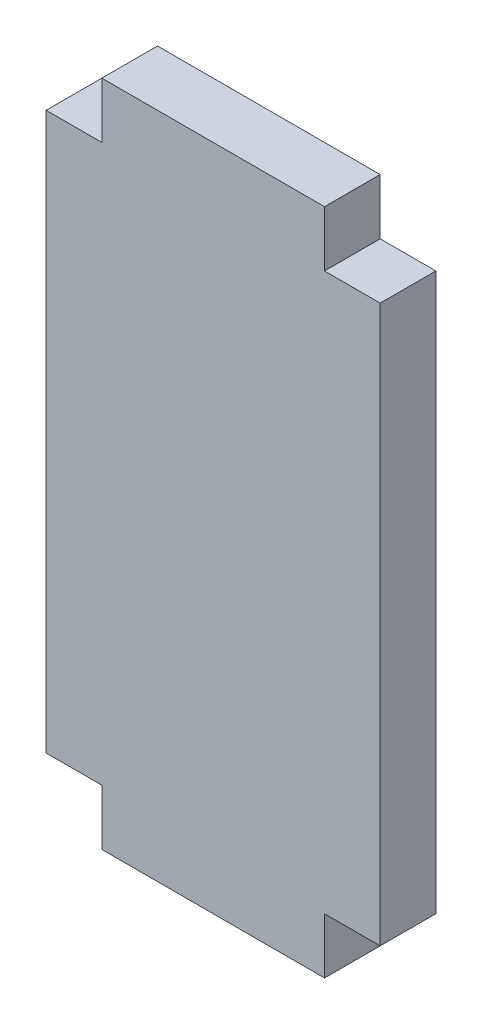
ISO-10303-21;
HEADER;
FILE_DESCRIPTION(('STEP AP214'),'2;1');
FILE_NAME('part.step','',(''),(''),'','','');
FILE_SCHEMA(('AUTOMOTIVE_DESIGN { 1 0 10303 214 1 1 1 1 }'));
ENDSEC;
DATA;
#1=APPLICATION_CONTEXT('core data for automotive mechanical design processes');
#2=APPLICATION_PROTOCOL_DEFINITION('international standard','automotive_design',2000,#1);
#3=PRODUCT_CONTEXT('',#1,'mechanical');
#4=PRODUCT('Part','Part','',(#3));
#5=PRODUCT_RELATED_PRODUCT_CATEGORY('part','',(#4));
#6=PRODUCT_DEFINITION_FORMATION('','',#4);
#7=PRODUCT_DEFINITION_CONTEXT('part definition',#1,'design');
#8=PRODUCT_DEFINITION('design','',#6,#7);
#9=PRODUCT_DEFINITION_SHAPE('','',#8);
#10=(LENGTH_UNIT() NAMED_UNIT(*) SI_UNIT(.MILLI.,.METRE.));
#11=(NAMED_UNIT(*) PLANE_ANGLE_UNIT() SI_UNIT($,.RADIAN.));
#12=(NAMED_UNIT(*) SI_UNIT($,.STERADIAN.) SOLID_ANGLE_UNIT());
#13=UNCERTAINTY_MEASURE_WITH_UNIT(LENGTH_MEASURE(1.E-05),#10,'distance_accuracy_value','');
#14=(GEOMETRIC_REPRESENTATION_CONTEXT(3) GLOBAL_UNCERTAINTY_ASSIGNED_CONTEXT((#13)) GLOBAL_UNIT_ASSIGNED_CONTEXT((#10,
#11,#12)) REPRESENTATION_CONTEXT('',''));
#15=CARTESIAN_POINT('',(0.,0.,0.));
#16=DIRECTION('',(0.,0.,1.));
#17=DIRECTION('',(1.,0.,0.));
#18=AXIS2_PLACEMENT_3D('',#15,#16,#17);
#19=CARTESIAN_POINT('',(9.525,19.05,1.5875));
#20=DIRECTION('',(-1.,0.,0.));
#21=DIRECTION('',(0.,0.,1.));
#22=AXIS2_PLACEMENT_3D('',#19,#20,#21);
#23=PLANE('',#22);
#24=DIRECTION('',(0.,1.,0.));
#25=VECTOR('',#24,1.);
#26=CARTESIAN_POINT('',(9.525,19.05,1.5875));
#27=LINE('',#26,#25);
#28=CARTESIAN_POINT('',(9.525,-15.875,1.5875));
#29=VERTEX_POINT('',#28);
#30=CARTESIAN_POINT('',(9.525,15.875,1.5875));
#31=VERTEX_POINT('',#30);
#32=EDGE_CURVE('E140',#29,#31,#27,.T.);
#33=ORIENTED_EDGE('',*,*,#32,.F.);
#34=DIRECTION('',(0.,0.,1.));
#35=VECTOR('',#34,1.);
#36=CARTESIAN_POINT('',(9.525,-15.875,-1.5875));
#37=LINE('',#36,#35);
#38=CARTESIAN_POINT('',(9.525,-15.875,-1.5875));
#39=VERTEX_POINT('',#38);
#40=EDGE_CURVE('E196',#39,#29,#37,.T.);
#41=ORIENTED_EDGE('',*,*,#40,.F.);
#42=DIRECTION('',(0.,1.,0.));
#43=VECTOR('',#42,1.);
#44=CARTESIAN_POINT('',(9.525,19.05,-1.5875));
#45=LINE('',#44,#43);
#46=CARTESIAN_POINT('',(9.525,15.875,-1.5875));
#47=VERTEX_POINT('',#46);
#48=EDGE_CURVE('E150',#39,#47,#45,.T.);
#49=ORIENTED_EDGE('',*,*,#48,.T.);
#50=DIRECTION('',(0.,0.,1.));
#51=VECTOR('',#50,1.);
#52=CARTESIAN_POINT('',(9.525,15.875,-1.5875));
#53=LINE('',#52,#51);
#54=EDGE_CURVE('E172',#47,#31,#53,.T.);
#55=ORIENTED_EDGE('',*,*,#54,.T.);
#56=EDGE_LOOP('',(#33,#41,#49,#55));
#57=FACE_BOUND('',#56,.T.);
#58=ADVANCED_FACE('F33',(#57),#23,.F.);
#59=CARTESIAN_POINT('',(-9.525,19.05,1.5875));
#60=DIRECTION('',(0.,-1.,0.));
#61=DIRECTION('',(0.,0.,-1.));
#62=AXIS2_PLACEMENT_3D('',#59,#60,#61);
#63=PLANE('',#62);
#64=DIRECTION('',(-1.,0.,0.));
#65=VECTOR('',#64,1.);
#66=CARTESIAN_POINT('',(-9.525,19.05,1.5875));
#67=LINE('',#66,#65);
#68=CARTESIAN_POINT('',(6.35,19.05,1.5875));
#69=VERTEX_POINT('',#68);
#70=CARTESIAN_POINT('',(-6.35,19.05,1.5875));
#71=VERTEX_POINT('',#70);
#72=EDGE_CURVE('E142',#69,#71,#67,.T.);
#73=ORIENTED_EDGE('',*,*,#72,.F.);
#74=DIRECTION('',(0.,0.,1.));
#75=VECTOR('',#74,1.);
#76=CARTESIAN_POINT('',(6.35,19.05,-1.5875));
#77=LINE('',#76,#75);
#78=CARTESIAN_POINT('',(6.35,19.05,-1.5875));
#79=VERTEX_POINT('',#78);
#80=EDGE_CURVE('E177',#79,#69,#77,.T.);
#81=ORIENTED_EDGE('',*,*,#80,.F.);
#82=DIRECTION('',(-1.,0.,0.));
#83=VECTOR('',#82,1.);
#84=CARTESIAN_POINT('',(-9.525,19.05,-1.5875));
#85=LINE('',#84,#83);
#86=CARTESIAN_POINT('',(-6.35,19.05,-1.5875));
#87=VERTEX_POINT('',#86);
#88=EDGE_CURVE('E145',#79,#87,#85,.T.);
#89=ORIENTED_EDGE('',*,*,#88,.T.);
#90=DIRECTION('',(0.,0.,1.));
#91=VECTOR('',#90,1.);
#92=CARTESIAN_POINT('',(-6.35,19.05,-1.5875));
#93=LINE('',#92,#91);
#94=EDGE_CURVE('E153',#87,#71,#93,.T.);
#95=ORIENTED_EDGE('',*,*,#94,.T.);
#96=EDGE_LOOP('',(#73,#81,#89,#95));
#97=FACE_BOUND('',#96,.T.);
#98=ADVANCED_FACE('F233',(#97),#63,.F.);
#99=CARTESIAN_POINT('',(-9.525,19.05,1.5875));
#100=DIRECTION('',(1.,0.,0.));
#101=DIRECTION('',(0.,1.,0.));
#102=AXIS2_PLACEMENT_3D('',#99,#100,#101);
#103=PLANE('',#102);
#104=DIRECTION('',(0.,-1.,0.));
#105=VECTOR('',#104,1.);
#106=CARTESIAN_POINT('',(-9.525,19.05,-1.5875));
#107=LINE('',#106,#105);
#108=CARTESIAN_POINT('',(-9.525,15.875,-1.5875));
#109=VERTEX_POINT('',#108);
#110=CARTESIAN_POINT('',(-9.525,-15.875,-1.5875));
#111=VERTEX_POINT('',#110);
#112=EDGE_CURVE('E141',#109,#111,#107,.T.);
#113=ORIENTED_EDGE('',*,*,#112,.T.);
#114=DIRECTION('',(0.,0.,1.));
#115=VECTOR('',#114,1.);
#116=CARTESIAN_POINT('',(-9.525,-15.875,-1.5875));
#117=LINE('',#116,#115);
#118=CARTESIAN_POINT('',(-9.525,-15.875,1.5875));
#119=VERTEX_POINT('',#118);
#120=EDGE_CURVE('E208',#111,#119,#117,.T.);
#121=ORIENTED_EDGE('',*,*,#120,.T.);
#122=DIRECTION('',(0.,-1.,0.));
#123=VECTOR('',#122,1.);
#124=CARTESIAN_POINT('',(-9.525,19.05,1.5875));
#125=LINE('',#124,#123);
#126=CARTESIAN_POINT('',(-9.525,15.875,1.5875));
#127=VERTEX_POINT('',#126);
#128=EDGE_CURVE('E41',#127,#119,#125,.T.);
#129=ORIENTED_EDGE('',*,*,#128,.F.);
#130=DIRECTION('',(0.,0.,1.));
#131=VECTOR('',#130,1.);
#132=CARTESIAN_POINT('',(-9.525,15.875,-1.5875));
#133=LINE('',#132,#131);
#134=EDGE_CURVE('E158',#109,#127,#133,.T.);
#135=ORIENTED_EDGE('',*,*,#134,.F.);
#136=EDGE_LOOP('',(#113,#121,#129,#135));
#137=FACE_BOUND('',#136,.T.);
#138=ADVANCED_FACE('F222',(#137),#103,.F.);
#139=CARTESIAN_POINT('',(-9.525,-19.05,1.5875));
#140=DIRECTION('',(0.,1.,0.));
#141=DIRECTION('',(0.,0.,1.));
#142=AXIS2_PLACEMENT_3D('',#139,#140,#141);
#143=PLANE('',#142);
#144=DIRECTION('',(1.,0.,0.));
#145=VECTOR('',#144,1.);
#146=CARTESIAN_POINT('',(-9.525,-19.05,1.5875));
#147=LINE('',#146,#145);
#148=CARTESIAN_POINT('',(-6.35,-19.05,1.5875));
#149=VERTEX_POINT('',#148);
#150=CARTESIAN_POINT('',(6.35,-19.05,1.5875));
#151=VERTEX_POINT('',#150);
#152=EDGE_CURVE('E11',#149,#151,#147,.T.);
#153=ORIENTED_EDGE('',*,*,#152,.F.);
#154=DIRECTION('',(0.,0.,1.));
#155=VECTOR('',#154,1.);
#156=CARTESIAN_POINT('',(-6.35,-19.05,-1.5875));
#157=LINE('',#156,#155);
#158=CARTESIAN_POINT('',(-6.35,-19.05,-1.5875));
#159=VERTEX_POINT('',#158);
#160=EDGE_CURVE('E126',#159,#149,#157,.T.);
#161=ORIENTED_EDGE('',*,*,#160,.F.);
#162=DIRECTION('',(1.,0.,0.));
#163=VECTOR('',#162,1.);
#164=CARTESIAN_POINT('',(-9.525,-19.05,-1.5875));
#165=LINE('',#164,#163);
#166=CARTESIAN_POINT('',(6.35,-19.05,-1.5875));
#167=VERTEX_POINT('',#166);
#168=EDGE_CURVE('E36',#159,#167,#165,.T.);
#169=ORIENTED_EDGE('',*,*,#168,.T.);
#170=DIRECTION('',(0.,0.,1.));
#171=VECTOR('',#170,1.);
#172=CARTESIAN_POINT('',(6.35,-19.05,-1.5875));
#173=LINE('',#172,#171);
#174=EDGE_CURVE('E191',#167,#151,#173,.T.);
#175=ORIENTED_EDGE('',*,*,#174,.T.);
#176=EDGE_LOOP('',(#153,#161,#169,#175));
#177=FACE_BOUND('',#176,.T.);
#178=ADVANCED_FACE('F135',(#177),#143,.F.);
#179=CARTESIAN_POINT('',(9.525,-19.05,1.5875));
#180=DIRECTION('',(0.,0.,1.));
#181=DIRECTION('',(1.,0.,0.));
#182=AXIS2_PLACEMENT_3D('',#179,#180,#181);
#183=PLANE('',#182);
#184=DIRECTION('',(-1.,0.,0.));
#185=VECTOR('',#184,1.);
#186=CARTESIAN_POINT('',(-9.525,-15.875,1.5875));
#187=LINE('',#186,#185);
#188=CARTESIAN_POINT('',(-6.35,-15.875,1.5875));
#189=VERTEX_POINT('',#188);
#190=EDGE_CURVE('E131',#189,#119,#187,.T.);
#191=ORIENTED_EDGE('',*,*,#190,.F.);
#192=DIRECTION('',(0.,1.,0.));
#193=VECTOR('',#192,1.);
#194=CARTESIAN_POINT('',(-6.35,-19.05,1.5875));
#195=LINE('',#194,#193);
#196=EDGE_CURVE('E214',#149,#189,#195,.T.);
#197=ORIENTED_EDGE('',*,*,#196,.F.);
#198=ORIENTED_EDGE('',*,*,#152,.T.);
#199=DIRECTION('',(0.,-1.,0.));
#200=VECTOR('',#199,1.);
#201=CARTESIAN_POINT('',(6.35,-19.05,1.5875));
#202=LINE('',#201,#200);
#203=CARTESIAN_POINT('',(6.35,-15.875,1.5875));
#204=VERTEX_POINT('',#203);
#205=EDGE_CURVE('E201',#204,#151,#202,.T.);
#206=ORIENTED_EDGE('',*,*,#205,.F.);
#207=DIRECTION('',(-1.,0.,0.));
#208=VECTOR('',#207,1.);
#209=CARTESIAN_POINT('',(9.525,-15.875,1.5875));
#210=LINE('',#209,#208);
#211=EDGE_CURVE('E205',#29,#204,#210,.T.);
#212=ORIENTED_EDGE('',*,*,#211,.F.);
#213=ORIENTED_EDGE('',*,*,#32,.T.);
#214=DIRECTION('',(1.,0.,0.));
#215=VECTOR('',#214,1.);
#216=CARTESIAN_POINT('',(9.525,15.875,1.5875));
#217=LINE('',#216,#215);
#218=CARTESIAN_POINT('',(6.35,15.875,1.5875));
#219=VERTEX_POINT('',#218);
#220=EDGE_CURVE('E184',#219,#31,#217,.T.);
#221=ORIENTED_EDGE('',*,*,#220,.F.);
#222=DIRECTION('',(0.,-1.,0.));
#223=VECTOR('',#222,1.);
#224=CARTESIAN_POINT('',(6.35,19.05,1.5875));
#225=LINE('',#224,#223);
#226=EDGE_CURVE('E188',#69,#219,#225,.T.);
#227=ORIENTED_EDGE('',*,*,#226,.F.);
#228=ORIENTED_EDGE('',*,*,#72,.T.);
#229=DIRECTION('',(0.,1.,0.));
#230=VECTOR('',#229,1.);
#231=CARTESIAN_POINT('',(-6.35,19.05,1.5875));
#232=LINE('',#231,#230);
#233=CARTESIAN_POINT('',(-6.35,15.875,1.5875));
#234=VERTEX_POINT('',#233);
#235=EDGE_CURVE('E165',#234,#71,#232,.T.);
#236=ORIENTED_EDGE('',*,*,#235,.F.);
#237=DIRECTION('',(1.,0.,0.));
#238=VECTOR('',#237,1.);
#239=CARTESIAN_POINT('',(-9.525,15.875,1.5875));
#240=LINE('',#239,#238);
#241=EDGE_CURVE('E169',#127,#234,#240,.T.);
#242=ORIENTED_EDGE('',*,*,#241,.F.);
#243=ORIENTED_EDGE('',*,*,#128,.T.);
#244=EDGE_LOOP('',(#191,#197,#198,#206,#212,#213,#221,#227,#228,#236,#242,#243));
#245=FACE_BOUND('',#244,.T.);
#246=ADVANCED_FACE('F225',(#245),#183,.T.);
#247=CARTESIAN_POINT('',(9.525,-19.05,-1.5875));
#248=DIRECTION('',(0.,0.,1.));
#249=DIRECTION('',(1.,0.,0.));
#250=AXIS2_PLACEMENT_3D('',#247,#248,#249);
#251=PLANE('',#250);
#252=DIRECTION('',(0.,1.,0.));
#253=VECTOR('',#252,1.);
#254=CARTESIAN_POINT('',(-6.35,-19.05,-1.5875));
#255=LINE('',#254,#253);
#256=CARTESIAN_POINT('',(-6.35,-15.875,-1.5875));
#257=VERTEX_POINT('',#256);
#258=EDGE_CURVE('E122',#159,#257,#255,.T.);
#259=ORIENTED_EDGE('',*,*,#258,.T.);
#260=DIRECTION('',(-1.,0.,0.));
#261=VECTOR('',#260,1.);
#262=CARTESIAN_POINT('',(-9.525,-15.875,-1.5875));
#263=LINE('',#262,#261);
#264=EDGE_CURVE('E49',#257,#111,#263,.T.);
#265=ORIENTED_EDGE('',*,*,#264,.T.);
#266=ORIENTED_EDGE('',*,*,#112,.F.);
#267=DIRECTION('',(1.,0.,0.));
#268=VECTOR('',#267,1.);
#269=CARTESIAN_POINT('',(-9.525,15.875,-1.5875));
#270=LINE('',#269,#268);
#271=CARTESIAN_POINT('',(-6.35,15.875,-1.5875));
#272=VERTEX_POINT('',#271);
#273=EDGE_CURVE('E168',#109,#272,#270,.T.);
#274=ORIENTED_EDGE('',*,*,#273,.T.);
#275=DIRECTION('',(0.,1.,0.));
#276=VECTOR('',#275,1.);
#277=CARTESIAN_POINT('',(-6.35,19.05,-1.5875));
#278=LINE('',#277,#276);
#279=EDGE_CURVE('E161',#272,#87,#278,.T.);
#280=ORIENTED_EDGE('',*,*,#279,.T.);
#281=ORIENTED_EDGE('',*,*,#88,.F.);
#282=DIRECTION('',(0.,-1.,0.));
#283=VECTOR('',#282,1.);
#284=CARTESIAN_POINT('',(6.35,19.05,-1.5875));
#285=LINE('',#284,#283);
#286=CARTESIAN_POINT('',(6.35,15.875,-1.5875));
#287=VERTEX_POINT('',#286);
#288=EDGE_CURVE('E187',#79,#287,#285,.T.);
#289=ORIENTED_EDGE('',*,*,#288,.T.);
#290=DIRECTION('',(1.,0.,0.));
#291=VECTOR('',#290,1.);
#292=CARTESIAN_POINT('',(9.525,15.875,-1.5875));
#293=LINE('',#292,#291);
#294=EDGE_CURVE('E180',#287,#47,#293,.T.);
#295=ORIENTED_EDGE('',*,*,#294,.T.);
#296=ORIENTED_EDGE('',*,*,#48,.F.);
#297=DIRECTION('',(-1.,0.,0.));
#298=VECTOR('',#297,1.);
#299=CARTESIAN_POINT('',(9.525,-15.875,-1.5875));
#300=LINE('',#299,#298);
#301=CARTESIAN_POINT('',(6.35,-15.875,-1.5875));
#302=VERTEX_POINT('',#301);
#303=EDGE_CURVE('E204',#39,#302,#300,.T.);
#304=ORIENTED_EDGE('',*,*,#303,.T.);
#305=DIRECTION('',(0.,-1.,0.));
#306=VECTOR('',#305,1.);
#307=CARTESIAN_POINT('',(6.35,-19.05,-1.5875));
#308=LINE('',#307,#306);
#309=EDGE_CURVE('E57',#302,#167,#308,.T.);
#310=ORIENTED_EDGE('',*,*,#309,.T.);
#311=ORIENTED_EDGE('',*,*,#168,.F.);
#312=EDGE_LOOP('',(#259,#265,#266,#274,#280,#281,#289,#295,#296,#304,#310,#311));
#313=FACE_BOUND('',#312,.T.);
#314=ADVANCED_FACE('F138',(#313),#251,.F.);
#315=CARTESIAN_POINT('',(-6.35,19.05,-1.5875));
#316=DIRECTION('',(1.,0.,0.));
#317=DIRECTION('',(0.,1.,0.));
#318=AXIS2_PLACEMENT_3D('',#315,#316,#317);
#319=PLANE('',#318);
#320=ORIENTED_EDGE('',*,*,#235,.T.);
#321=ORIENTED_EDGE('',*,*,#94,.F.);
#322=ORIENTED_EDGE('',*,*,#279,.F.);
#323=DIRECTION('',(0.,0.,1.));
#324=VECTOR('',#323,1.);
#325=CARTESIAN_POINT('',(-6.35,15.875,-1.5875));
#326=LINE('',#325,#324);
#327=EDGE_CURVE('E160',#272,#234,#326,.T.);
#328=ORIENTED_EDGE('',*,*,#327,.T.);
#329=EDGE_LOOP('',(#320,#321,#322,#328));
#330=FACE_BOUND('',#329,.T.);
#331=ADVANCED_FACE('F231',(#330),#319,.F.);
#332=CARTESIAN_POINT('',(-9.525,15.875,-1.5875));
#333=DIRECTION('',(0.,-1.,0.));
#334=DIRECTION('',(0.,0.,-1.));
#335=AXIS2_PLACEMENT_3D('',#332,#333,#334);
#336=PLANE('',#335);
#337=ORIENTED_EDGE('',*,*,#241,.T.);
#338=ORIENTED_EDGE('',*,*,#327,.F.);
#339=ORIENTED_EDGE('',*,*,#273,.F.);
#340=ORIENTED_EDGE('',*,*,#134,.T.);
#341=EDGE_LOOP('',(#337,#338,#339,#340));
#342=FACE_BOUND('',#341,.T.);
#343=ADVANCED_FACE('F219',(#342),#336,.F.);
#344=CARTESIAN_POINT('',(9.525,15.875,-1.5875));
#345=DIRECTION('',(0.,-1.,0.));
#346=DIRECTION('',(0.,0.,-1.));
#347=AXIS2_PLACEMENT_3D('',#344,#345,#346);
#348=PLANE('',#347);
#349=ORIENTED_EDGE('',*,*,#220,.T.);
#350=ORIENTED_EDGE('',*,*,#54,.F.);
#351=ORIENTED_EDGE('',*,*,#294,.F.);
#352=DIRECTION('',(0.,0.,1.));
#353=VECTOR('',#352,1.);
#354=CARTESIAN_POINT('',(6.35,15.875,-1.5875));
#355=LINE('',#354,#353);
#356=EDGE_CURVE('E179',#287,#219,#355,.T.);
#357=ORIENTED_EDGE('',*,*,#356,.T.);
#358=EDGE_LOOP('',(#349,#350,#351,#357));
#359=FACE_BOUND('',#358,.T.);
#360=ADVANCED_FACE('F241',(#359),#348,.F.);
#361=CARTESIAN_POINT('',(6.35,19.05,-1.5875));
#362=DIRECTION('',(-1.,0.,0.));
#363=DIRECTION('',(0.,-1.,0.));
#364=AXIS2_PLACEMENT_3D('',#361,#362,#363);
#365=PLANE('',#364);
#366=ORIENTED_EDGE('',*,*,#226,.T.);
#367=ORIENTED_EDGE('',*,*,#356,.F.);
#368=ORIENTED_EDGE('',*,*,#288,.F.);
#369=ORIENTED_EDGE('',*,*,#80,.T.);
#370=EDGE_LOOP('',(#366,#367,#368,#369));
#371=FACE_BOUND('',#370,.T.);
#372=ADVANCED_FACE('F238',(#371),#365,.F.);
#373=CARTESIAN_POINT('',(6.35,-19.05,-1.5875));
#374=DIRECTION('',(-1.,0.,0.));
#375=DIRECTION('',(0.,-1.,0.));
#376=AXIS2_PLACEMENT_3D('',#373,#374,#375);
#377=PLANE('',#376);
#378=ORIENTED_EDGE('',*,*,#205,.T.);
#379=ORIENTED_EDGE('',*,*,#174,.F.);
#380=ORIENTED_EDGE('',*,*,#309,.F.);
#381=DIRECTION('',(0.,0.,1.));
#382=VECTOR('',#381,1.);
#383=CARTESIAN_POINT('',(6.35,-15.875,-1.5875));
#384=LINE('',#383,#382);
#385=EDGE_CURVE('E198',#302,#204,#384,.T.);
#386=ORIENTED_EDGE('',*,*,#385,.T.);
#387=EDGE_LOOP('',(#378,#379,#380,#386));
#388=FACE_BOUND('',#387,.T.);
#389=ADVANCED_FACE('F250',(#388),#377,.F.);
#390=CARTESIAN_POINT('',(9.525,-15.875,-1.5875));
#391=DIRECTION('',(0.,1.,0.));
#392=DIRECTION('',(0.,0.,1.));
#393=AXIS2_PLACEMENT_3D('',#390,#391,#392);
#394=PLANE('',#393);
#395=ORIENTED_EDGE('',*,*,#211,.T.);
#396=ORIENTED_EDGE('',*,*,#385,.F.);
#397=ORIENTED_EDGE('',*,*,#303,.F.);
#398=ORIENTED_EDGE('',*,*,#40,.T.);
#399=EDGE_LOOP('',(#395,#396,#397,#398));
#400=FACE_BOUND('',#399,.T.);
#401=ADVANCED_FACE('F247',(#400),#394,.F.);
#402=CARTESIAN_POINT('',(-9.525,-15.875,-1.5875));
#403=DIRECTION('',(0.,1.,0.));
#404=DIRECTION('',(0.,0.,1.));
#405=AXIS2_PLACEMENT_3D('',#402,#403,#404);
#406=PLANE('',#405);
#407=ORIENTED_EDGE('',*,*,#190,.T.);
#408=ORIENTED_EDGE('',*,*,#120,.F.);
#409=ORIENTED_EDGE('',*,*,#264,.F.);
#410=DIRECTION('',(0.,0.,1.));
#411=VECTOR('',#410,1.);
#412=CARTESIAN_POINT('',(-6.35,-15.875,-1.5875));
#413=LINE('',#412,#411);
#414=EDGE_CURVE('E128',#257,#189,#413,.T.);
#415=ORIENTED_EDGE('',*,*,#414,.T.);
#416=EDGE_LOOP('',(#407,#408,#409,#415));
#417=FACE_BOUND('',#416,.T.);
#418=ADVANCED_FACE('F257',(#417),#406,.F.);
#419=CARTESIAN_POINT('',(-6.35,-19.05,-1.5875));
#420=DIRECTION('',(1.,0.,0.));
#421=DIRECTION('',(0.,1.,0.));
#422=AXIS2_PLACEMENT_3D('',#419,#420,#421);
#423=PLANE('',#422);
#424=ORIENTED_EDGE('',*,*,#196,.T.);
#425=ORIENTED_EDGE('',*,*,#414,.F.);
#426=ORIENTED_EDGE('',*,*,#258,.F.);
#427=ORIENTED_EDGE('',*,*,#160,.T.);
#428=EDGE_LOOP('',(#424,#425,#426,#427));
#429=FACE_BOUND('',#428,.T.);
#430=ADVANCED_FACE('F125',(#429),#423,.F.);
#431=CLOSED_SHELL('',(#58,#98,#138,#178,#246,#314,#331,#343,#360,#372,#389,#401,#418,#430));
#432=MANIFOLD_SOLID_BREP('B2',#431);
#433=ADVANCED_BREP_SHAPE_REPRESENTATION('',(#18,#432),#14);
#434=SHAPE_DEFINITION_REPRESENTATION(#9,#433);
ENDSEC;
END-ISO-10303-21;
